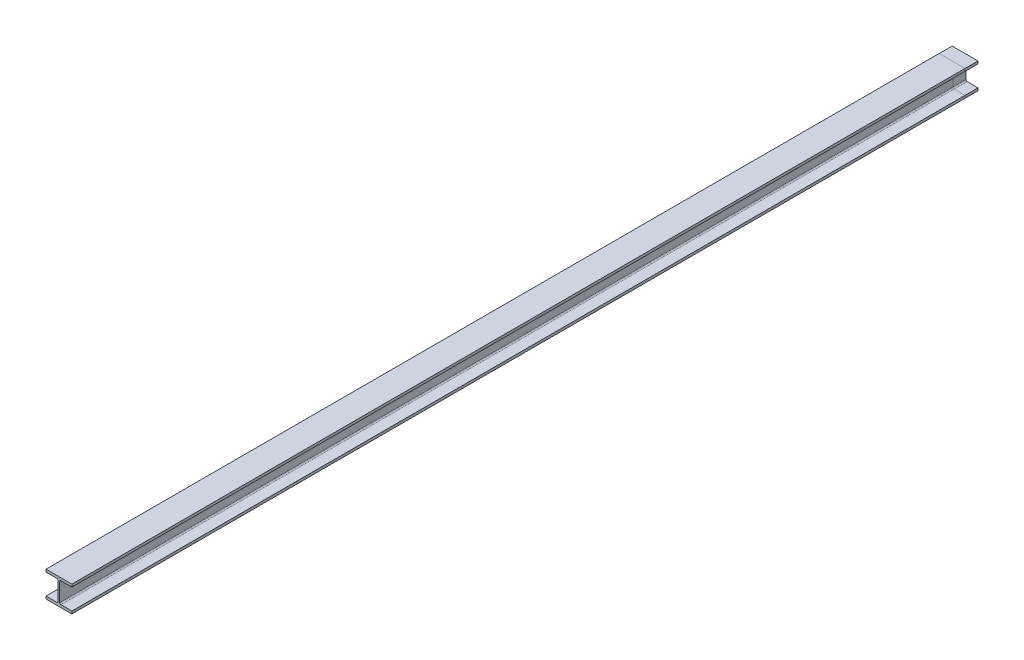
ISO-10303-21;
HEADER;
FILE_DESCRIPTION(('STEP AP214'),'2;1');
FILE_NAME('part.step','',(''),(''),'','','');
FILE_SCHEMA(('AUTOMOTIVE_DESIGN { 1 0 10303 214 1 1 1 1 }'));
ENDSEC;
DATA;
#1=APPLICATION_CONTEXT('core data for automotive mechanical design processes');
#2=APPLICATION_PROTOCOL_DEFINITION('international standard','automotive_design',2000,#1);
#3=PRODUCT_CONTEXT('',#1,'mechanical');
#4=PRODUCT('Part','Part','',(#3));
#5=PRODUCT_RELATED_PRODUCT_CATEGORY('part','',(#4));
#6=PRODUCT_DEFINITION_FORMATION('','',#4);
#7=PRODUCT_DEFINITION_CONTEXT('part definition',#1,'design');
#8=PRODUCT_DEFINITION('design','',#6,#7);
#9=PRODUCT_DEFINITION_SHAPE('','',#8);
#10=(LENGTH_UNIT() NAMED_UNIT(*) SI_UNIT(.MILLI.,.METRE.));
#11=(NAMED_UNIT(*) PLANE_ANGLE_UNIT() SI_UNIT($,.RADIAN.));
#12=(NAMED_UNIT(*) SI_UNIT($,.STERADIAN.) SOLID_ANGLE_UNIT());
#13=UNCERTAINTY_MEASURE_WITH_UNIT(LENGTH_MEASURE(1.E-05),#10,'distance_accuracy_value','');
#14=(GEOMETRIC_REPRESENTATION_CONTEXT(3) GLOBAL_UNCERTAINTY_ASSIGNED_CONTEXT((#13)) GLOBAL_UNIT_ASSIGNED_CONTEXT((#10,
#11,#12)) REPRESENTATION_CONTEXT('',''));
#15=CARTESIAN_POINT('',(0.,0.,0.));
#16=DIRECTION('',(0.,0.,1.));
#17=DIRECTION('',(1.,0.,0.));
#18=AXIS2_PLACEMENT_3D('',#15,#16,#17);
#19=CARTESIAN_POINT('',(50.,50.,1750.));
#20=DIRECTION('',(-1.,0.,0.));
#21=DIRECTION('',(0.,0.,1.));
#22=AXIS2_PLACEMENT_3D('',#19,#20,#21);
#23=PLANE('',#22);
#24=DIRECTION('',(0.,0.,-1.));
#25=VECTOR('',#24,1.);
#26=CARTESIAN_POINT('',(50.,50.,1750.));
#27=LINE('',#26,#25);
#28=CARTESIAN_POINT('',(50.,50.,-1700.));
#29=VERTEX_POINT('',#28);
#30=CARTESIAN_POINT('',(50.,50.,-1750.));
#31=VERTEX_POINT('',#30);
#32=EDGE_CURVE('E402',#29,#31,#27,.T.);
#33=ORIENTED_EDGE('',*,*,#32,.F.);
#34=DIRECTION('',(0.,-1.,0.));
#35=VECTOR('',#34,1.);
#36=CARTESIAN_POINT('',(50.,50.,-1700.));
#37=LINE('',#36,#35);
#38=CARTESIAN_POINT('',(50.,40.,-1700.));
#39=VERTEX_POINT('',#38);
#40=EDGE_CURVE('E13',#29,#39,#37,.T.);
#41=ORIENTED_EDGE('',*,*,#40,.T.);
#42=DIRECTION('',(0.,0.,-1.));
#43=VECTOR('',#42,1.);
#44=CARTESIAN_POINT('',(50.,40.,1750.));
#45=LINE('',#44,#43);
#46=CARTESIAN_POINT('',(50.,40.,-1750.));
#47=VERTEX_POINT('',#46);
#48=EDGE_CURVE('E406',#39,#47,#45,.T.);
#49=ORIENTED_EDGE('',*,*,#48,.T.);
#50=DIRECTION('',(0.,1.,0.));
#51=VECTOR('',#50,1.);
#52=CARTESIAN_POINT('',(50.,50.,-1750.));
#53=LINE('',#52,#51);
#54=EDGE_CURVE('E327',#47,#31,#53,.T.);
#55=ORIENTED_EDGE('',*,*,#54,.T.);
#56=EDGE_LOOP('',(#33,#41,#49,#55));
#57=FACE_BOUND('',#56,.T.);
#58=ADVANCED_FACE('F44',(#57),#23,.F.);
#59=CARTESIAN_POINT('',(50.,40.,1750.));
#60=DIRECTION('',(0.,1.,0.));
#61=DIRECTION('',(-1.,0.,0.));
#62=AXIS2_PLACEMENT_3D('',#59,#60,#61);
#63=PLANE('',#62);
#64=ORIENTED_EDGE('',*,*,#48,.F.);
#65=DIRECTION('',(-1.,0.,0.));
#66=VECTOR('',#65,1.);
#67=CARTESIAN_POINT('',(50.,40.,-1700.));
#68=LINE('',#67,#66);
#69=CARTESIAN_POINT('',(8.00000000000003,40.,-1700.));
#70=VERTEX_POINT('',#69);
#71=EDGE_CURVE('E52',#39,#70,#68,.T.);
#72=ORIENTED_EDGE('',*,*,#71,.T.);
#73=DIRECTION('',(0.,0.,-1.));
#74=VECTOR('',#73,1.);
#75=CARTESIAN_POINT('',(8.00000000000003,40.,1750.));
#76=LINE('',#75,#74);
#77=CARTESIAN_POINT('',(8.00000000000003,40.,-1750.));
#78=VERTEX_POINT('',#77);
#79=EDGE_CURVE('E266',#70,#78,#76,.T.);
#80=ORIENTED_EDGE('',*,*,#79,.T.);
#81=DIRECTION('',(1.,0.,0.));
#82=VECTOR('',#81,1.);
#83=CARTESIAN_POINT('',(50.,40.,-1750.));
#84=LINE('',#83,#82);
#85=EDGE_CURVE('E413',#78,#47,#84,.T.);
#86=ORIENTED_EDGE('',*,*,#85,.T.);
#87=EDGE_LOOP('',(#64,#72,#80,#86));
#88=FACE_BOUND('',#87,.T.);
#89=ADVANCED_FACE('F411',(#88),#63,.F.);
#90=CARTESIAN_POINT('',(7.99999999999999,35.,1750.));
#91=DIRECTION('',(0.,0.,-1.));
#92=DIRECTION('',(-1.,0.,0.));
#93=AXIS2_PLACEMENT_3D('',#90,#91,#92);
#94=CYLINDRICAL_SURFACE('',#93,5.);
#95=ORIENTED_EDGE('',*,*,#79,.F.);
#96=CARTESIAN_POINT('',(7.99999999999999,35.,-1700.));
#97=DIRECTION('',(0.,0.,1.));
#98=DIRECTION('',(-1.,0.,0.));
#99=AXIS2_PLACEMENT_3D('',#96,#97,#98);
#100=CIRCLE('',#99,5.);
#101=CARTESIAN_POINT('',(2.99999999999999,35.,-1700.));
#102=VERTEX_POINT('',#101);
#103=EDGE_CURVE('E258',#70,#102,#100,.T.);
#104=ORIENTED_EDGE('',*,*,#103,.T.);
#105=DIRECTION('',(0.,0.,-1.));
#106=VECTOR('',#105,1.);
#107=CARTESIAN_POINT('',(2.99999999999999,35.,1750.));
#108=LINE('',#107,#106);
#109=CARTESIAN_POINT('',(2.99999999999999,35.,-1750.));
#110=VERTEX_POINT('',#109);
#111=EDGE_CURVE('E264',#102,#110,#108,.T.);
#112=ORIENTED_EDGE('',*,*,#111,.T.);
#113=CARTESIAN_POINT('',(7.99999999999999,35.,-1750.));
#114=DIRECTION('',(0.,0.,-1.));
#115=DIRECTION('',(1.,0.,0.));
#116=AXIS2_PLACEMENT_3D('',#113,#114,#115);
#117=CIRCLE('',#116,5.);
#118=EDGE_CURVE('E311',#110,#78,#117,.T.);
#119=ORIENTED_EDGE('',*,*,#118,.T.);
#120=EDGE_LOOP('',(#95,#104,#112,#119));
#121=FACE_BOUND('',#120,.T.);
#122=ADVANCED_FACE('F261',(#121),#94,.F.);
#123=CARTESIAN_POINT('',(3.,35.,1750.));
#124=DIRECTION('',(-1.,0.,0.));
#125=DIRECTION('',(0.,0.,1.));
#126=AXIS2_PLACEMENT_3D('',#123,#124,#125);
#127=PLANE('',#126);
#128=ORIENTED_EDGE('',*,*,#111,.F.);
#129=DIRECTION('',(0.,-1.,0.));
#130=VECTOR('',#129,1.);
#131=CARTESIAN_POINT('',(3.,35.,-1700.));
#132=LINE('',#131,#130);
#133=CARTESIAN_POINT('',(3.,-35.,-1700.));
#134=VERTEX_POINT('',#133);
#135=EDGE_CURVE('E256',#102,#134,#132,.T.);
#136=ORIENTED_EDGE('',*,*,#135,.T.);
#137=DIRECTION('',(0.,0.,-1.));
#138=VECTOR('',#137,1.);
#139=CARTESIAN_POINT('',(3.,-35.,1750.));
#140=LINE('',#139,#138);
#141=CARTESIAN_POINT('',(3.,-35.,-1750.));
#142=VERTEX_POINT('',#141);
#143=EDGE_CURVE('E228',#134,#142,#140,.T.);
#144=ORIENTED_EDGE('',*,*,#143,.T.);
#145=DIRECTION('',(0.,1.,0.));
#146=VECTOR('',#145,1.);
#147=CARTESIAN_POINT('',(3.,35.,-1750.));
#148=LINE('',#147,#146);
#149=EDGE_CURVE('E273',#142,#110,#148,.T.);
#150=ORIENTED_EDGE('',*,*,#149,.T.);
#151=EDGE_LOOP('',(#128,#136,#144,#150));
#152=FACE_BOUND('',#151,.T.);
#153=ADVANCED_FACE('F271',(#152),#127,.F.);
#154=CARTESIAN_POINT('',(8.,-35.,1750.));
#155=DIRECTION('',(0.,0.,-1.));
#156=DIRECTION('',(-1.,0.,0.));
#157=AXIS2_PLACEMENT_3D('',#154,#155,#156);
#158=CYLINDRICAL_SURFACE('',#157,5.);
#159=ORIENTED_EDGE('',*,*,#143,.F.);
#160=CARTESIAN_POINT('',(8.,-35.,-1700.));
#161=DIRECTION('',(0.,0.,1.));
#162=DIRECTION('',(-1.,0.,0.));
#163=AXIS2_PLACEMENT_3D('',#160,#161,#162);
#164=CIRCLE('',#163,5.);
#165=CARTESIAN_POINT('',(8.00000000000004,-40.,-1700.));
#166=VERTEX_POINT('',#165);
#167=EDGE_CURVE('E225',#134,#166,#164,.T.);
#168=ORIENTED_EDGE('',*,*,#167,.T.);
#169=DIRECTION('',(0.,0.,-1.));
#170=VECTOR('',#169,1.);
#171=CARTESIAN_POINT('',(8.00000000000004,-40.,1750.));
#172=LINE('',#171,#170);
#173=CARTESIAN_POINT('',(8.00000000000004,-40.,-1750.));
#174=VERTEX_POINT('',#173);
#175=EDGE_CURVE('E305',#166,#174,#172,.T.);
#176=ORIENTED_EDGE('',*,*,#175,.T.);
#177=CARTESIAN_POINT('',(8.,-35.,-1750.));
#178=DIRECTION('',(0.,0.,-1.));
#179=DIRECTION('',(-1.,0.,0.));
#180=AXIS2_PLACEMENT_3D('',#177,#178,#179);
#181=CIRCLE('',#180,5.);
#182=EDGE_CURVE('E306',#174,#142,#181,.T.);
#183=ORIENTED_EDGE('',*,*,#182,.T.);
#184=EDGE_LOOP('',(#159,#168,#176,#183));
#185=FACE_BOUND('',#184,.T.);
#186=ADVANCED_FACE('F496',(#185),#158,.F.);
#187=CARTESIAN_POINT('',(50.,-40.,1750.));
#188=DIRECTION('',(0.,-1.,0.));
#189=DIRECTION('',(1.,0.,0.));
#190=AXIS2_PLACEMENT_3D('',#187,#188,#189);
#191=PLANE('',#190);
#192=ORIENTED_EDGE('',*,*,#175,.F.);
#193=DIRECTION('',(1.,0.,0.));
#194=VECTOR('',#193,1.);
#195=CARTESIAN_POINT('',(50.,-40.,-1700.));
#196=LINE('',#195,#194);
#197=CARTESIAN_POINT('',(50.,-40.,-1700.));
#198=VERTEX_POINT('',#197);
#199=EDGE_CURVE('E253',#166,#198,#196,.T.);
#200=ORIENTED_EDGE('',*,*,#199,.T.);
#201=DIRECTION('',(0.,0.,-1.));
#202=VECTOR('',#201,1.);
#203=CARTESIAN_POINT('',(50.,-40.,1750.));
#204=LINE('',#203,#202);
#205=CARTESIAN_POINT('',(50.,-40.,-1750.));
#206=VERTEX_POINT('',#205);
#207=EDGE_CURVE('E362',#198,#206,#204,.T.);
#208=ORIENTED_EDGE('',*,*,#207,.T.);
#209=DIRECTION('',(-1.,0.,0.));
#210=VECTOR('',#209,1.);
#211=CARTESIAN_POINT('',(50.,-40.,-1750.));
#212=LINE('',#211,#210);
#213=EDGE_CURVE('E222',#206,#174,#212,.T.);
#214=ORIENTED_EDGE('',*,*,#213,.T.);
#215=EDGE_LOOP('',(#192,#200,#208,#214));
#216=FACE_BOUND('',#215,.T.);
#217=ADVANCED_FACE('F493',(#216),#191,.F.);
#218=CARTESIAN_POINT('',(50.,-50.,1750.));
#219=DIRECTION('',(-1.,0.,0.));
#220=DIRECTION('',(0.,0.,1.));
#221=AXIS2_PLACEMENT_3D('',#218,#219,#220);
#222=PLANE('',#221);
#223=ORIENTED_EDGE('',*,*,#207,.F.);
#224=DIRECTION('',(0.,-1.,0.));
#225=VECTOR('',#224,1.);
#226=CARTESIAN_POINT('',(50.,-50.,-1700.));
#227=LINE('',#226,#225);
#228=CARTESIAN_POINT('',(50.,-50.,-1700.));
#229=VERTEX_POINT('',#228);
#230=EDGE_CURVE('E251',#198,#229,#227,.T.);
#231=ORIENTED_EDGE('',*,*,#230,.T.);
#232=DIRECTION('',(0.,0.,-1.));
#233=VECTOR('',#232,1.);
#234=CARTESIAN_POINT('',(50.,-50.,1750.));
#235=LINE('',#234,#233);
#236=CARTESIAN_POINT('',(50.,-50.,-1750.));
#237=VERTEX_POINT('',#236);
#238=EDGE_CURVE('E366',#229,#237,#235,.T.);
#239=ORIENTED_EDGE('',*,*,#238,.T.);
#240=DIRECTION('',(0.,1.,0.));
#241=VECTOR('',#240,1.);
#242=CARTESIAN_POINT('',(50.,-50.,-1750.));
#243=LINE('',#242,#241);
#244=EDGE_CURVE('E354',#237,#206,#243,.T.);
#245=ORIENTED_EDGE('',*,*,#244,.T.);
#246=EDGE_LOOP('',(#223,#231,#239,#245));
#247=FACE_BOUND('',#246,.T.);
#248=ADVANCED_FACE('F501',(#247),#222,.F.);
#249=CARTESIAN_POINT('',(-50.,-50.,1750.));
#250=DIRECTION('',(0.,1.,0.));
#251=DIRECTION('',(0.,0.,1.));
#252=AXIS2_PLACEMENT_3D('',#249,#250,#251);
#253=PLANE('',#252);
#254=ORIENTED_EDGE('',*,*,#238,.F.);
#255=DIRECTION('',(-1.,0.,0.));
#256=VECTOR('',#255,1.);
#257=CARTESIAN_POINT('',(-50.,-50.,-1700.));
#258=LINE('',#257,#256);
#259=CARTESIAN_POINT('',(-50.,-50.,-1700.));
#260=VERTEX_POINT('',#259);
#261=EDGE_CURVE('E249',#229,#260,#258,.T.);
#262=ORIENTED_EDGE('',*,*,#261,.T.);
#263=DIRECTION('',(0.,0.,-1.));
#264=VECTOR('',#263,1.);
#265=CARTESIAN_POINT('',(-50.,-50.,1750.));
#266=LINE('',#265,#264);
#267=CARTESIAN_POINT('',(-50.,-50.,-1750.));
#268=VERTEX_POINT('',#267);
#269=EDGE_CURVE('E370',#260,#268,#266,.T.);
#270=ORIENTED_EDGE('',*,*,#269,.T.);
#271=DIRECTION('',(1.,0.,0.));
#272=VECTOR('',#271,1.);
#273=CARTESIAN_POINT('',(-50.,-50.,-1750.));
#274=LINE('',#273,#272);
#275=EDGE_CURVE('E350',#268,#237,#274,.T.);
#276=ORIENTED_EDGE('',*,*,#275,.T.);
#277=EDGE_LOOP('',(#254,#262,#270,#276));
#278=FACE_BOUND('',#277,.T.);
#279=ADVANCED_FACE('F503',(#278),#253,.F.);
#280=CARTESIAN_POINT('',(-50.,-50.,1750.));
#281=DIRECTION('',(1.,0.,0.));
#282=DIRECTION('',(0.,0.,-1.));
#283=AXIS2_PLACEMENT_3D('',#280,#281,#282);
#284=PLANE('',#283);
#285=ORIENTED_EDGE('',*,*,#269,.F.);
#286=DIRECTION('',(0.,1.,0.));
#287=VECTOR('',#286,1.);
#288=CARTESIAN_POINT('',(-50.,-50.,-1700.));
#289=LINE('',#288,#287);
#290=CARTESIAN_POINT('',(-50.,-40.,-1700.));
#291=VERTEX_POINT('',#290);
#292=EDGE_CURVE('E247',#260,#291,#289,.T.);
#293=ORIENTED_EDGE('',*,*,#292,.T.);
#294=DIRECTION('',(0.,0.,-1.));
#295=VECTOR('',#294,1.);
#296=CARTESIAN_POINT('',(-50.,-40.,1750.));
#297=LINE('',#296,#295);
#298=CARTESIAN_POINT('',(-50.,-40.,-1750.));
#299=VERTEX_POINT('',#298);
#300=EDGE_CURVE('E374',#291,#299,#297,.T.);
#301=ORIENTED_EDGE('',*,*,#300,.T.);
#302=DIRECTION('',(0.,-1.,0.));
#303=VECTOR('',#302,1.);
#304=CARTESIAN_POINT('',(-50.,-50.,-1750.));
#305=LINE('',#304,#303);
#306=EDGE_CURVE('E348',#299,#268,#305,.T.);
#307=ORIENTED_EDGE('',*,*,#306,.T.);
#308=EDGE_LOOP('',(#285,#293,#301,#307));
#309=FACE_BOUND('',#308,.T.);
#310=ADVANCED_FACE('F505',(#309),#284,.F.);
#311=CARTESIAN_POINT('',(-50.,-40.,1750.));
#312=DIRECTION('',(0.,-1.,0.));
#313=DIRECTION('',(1.,0.,0.));
#314=AXIS2_PLACEMENT_3D('',#311,#312,#313);
#315=PLANE('',#314);
#316=ORIENTED_EDGE('',*,*,#300,.F.);
#317=DIRECTION('',(1.,0.,0.));
#318=VECTOR('',#317,1.);
#319=CARTESIAN_POINT('',(-50.,-40.,-1700.));
#320=LINE('',#319,#318);
#321=CARTESIAN_POINT('',(-8.00000000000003,-40.,-1700.));
#322=VERTEX_POINT('',#321);
#323=EDGE_CURVE('E245',#291,#322,#320,.T.);
#324=ORIENTED_EDGE('',*,*,#323,.T.);
#325=DIRECTION('',(0.,0.,-1.));
#326=VECTOR('',#325,1.);
#327=CARTESIAN_POINT('',(-8.00000000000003,-40.,1750.));
#328=LINE('',#327,#326);
#329=CARTESIAN_POINT('',(-8.00000000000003,-40.,-1750.));
#330=VERTEX_POINT('',#329);
#331=EDGE_CURVE('E378',#322,#330,#328,.T.);
#332=ORIENTED_EDGE('',*,*,#331,.T.);
#333=DIRECTION('',(-1.,0.,0.));
#334=VECTOR('',#333,1.);
#335=CARTESIAN_POINT('',(-50.,-40.,-1750.));
#336=LINE('',#335,#334);
#337=EDGE_CURVE('E345',#330,#299,#336,.T.);
#338=ORIENTED_EDGE('',*,*,#337,.T.);
#339=EDGE_LOOP('',(#316,#324,#332,#338));
#340=FACE_BOUND('',#339,.T.);
#341=ADVANCED_FACE('F511',(#340),#315,.F.);
#342=CARTESIAN_POINT('',(-7.99999999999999,-35.,1750.));
#343=DIRECTION('',(0.,0.,-1.));
#344=DIRECTION('',(-1.,0.,0.));
#345=AXIS2_PLACEMENT_3D('',#342,#343,#344);
#346=CYLINDRICAL_SURFACE('',#345,5.);
#347=ORIENTED_EDGE('',*,*,#331,.F.);
#348=CARTESIAN_POINT('',(-7.99999999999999,-35.,-1700.));
#349=DIRECTION('',(0.,0.,1.));
#350=DIRECTION('',(-1.,0.,0.));
#351=AXIS2_PLACEMENT_3D('',#348,#349,#350);
#352=CIRCLE('',#351,5.);
#353=CARTESIAN_POINT('',(-2.99999999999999,-35.,-1700.));
#354=VERTEX_POINT('',#353);
#355=EDGE_CURVE('E243',#322,#354,#352,.T.);
#356=ORIENTED_EDGE('',*,*,#355,.T.);
#357=DIRECTION('',(0.,0.,-1.));
#358=VECTOR('',#357,1.);
#359=CARTESIAN_POINT('',(-2.99999999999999,-35.,1750.));
#360=LINE('',#359,#358);
#361=CARTESIAN_POINT('',(-2.99999999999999,-35.,-1750.));
#362=VERTEX_POINT('',#361);
#363=EDGE_CURVE('E382',#354,#362,#360,.T.);
#364=ORIENTED_EDGE('',*,*,#363,.T.);
#365=CARTESIAN_POINT('',(-7.99999999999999,-35.,-1750.));
#366=DIRECTION('',(0.,0.,-1.));
#367=DIRECTION('',(-1.,0.,0.));
#368=AXIS2_PLACEMENT_3D('',#365,#366,#367);
#369=CIRCLE('',#368,5.);
#370=EDGE_CURVE('E342',#362,#330,#369,.T.);
#371=ORIENTED_EDGE('',*,*,#370,.T.);
#372=EDGE_LOOP('',(#347,#356,#364,#371));
#373=FACE_BOUND('',#372,.T.);
#374=ADVANCED_FACE('F513',(#373),#346,.F.);
#375=CARTESIAN_POINT('',(-2.99999999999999,35.,1750.));
#376=DIRECTION('',(1.,0.,0.));
#377=DIRECTION('',(0.,0.,-1.));
#378=AXIS2_PLACEMENT_3D('',#375,#376,#377);
#379=PLANE('',#378);
#380=ORIENTED_EDGE('',*,*,#363,.F.);
#381=DIRECTION('',(0.,1.,0.));
#382=VECTOR('',#381,1.);
#383=CARTESIAN_POINT('',(-2.99999999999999,35.,-1700.));
#384=LINE('',#383,#382);
#385=CARTESIAN_POINT('',(-2.99999999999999,35.,-1700.));
#386=VERTEX_POINT('',#385);
#387=EDGE_CURVE('E241',#354,#386,#384,.T.);
#388=ORIENTED_EDGE('',*,*,#387,.T.);
#389=DIRECTION('',(0.,0.,-1.));
#390=VECTOR('',#389,1.);
#391=CARTESIAN_POINT('',(-2.99999999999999,35.,1750.));
#392=LINE('',#391,#390);
#393=CARTESIAN_POINT('',(-2.99999999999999,35.,-1750.));
#394=VERTEX_POINT('',#393);
#395=EDGE_CURVE('E386',#386,#394,#392,.T.);
#396=ORIENTED_EDGE('',*,*,#395,.T.);
#397=DIRECTION('',(0.,-1.,0.));
#398=VECTOR('',#397,1.);
#399=CARTESIAN_POINT('',(-2.99999999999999,35.,-1750.));
#400=LINE('',#399,#398);
#401=EDGE_CURVE('E337',#394,#362,#400,.T.);
#402=ORIENTED_EDGE('',*,*,#401,.T.);
#403=EDGE_LOOP('',(#380,#388,#396,#402));
#404=FACE_BOUND('',#403,.T.);
#405=ADVANCED_FACE('F515',(#404),#379,.F.);
#406=CARTESIAN_POINT('',(-7.99999999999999,35.,1750.));
#407=DIRECTION('',(0.,0.,-1.));
#408=DIRECTION('',(-1.,0.,0.));
#409=AXIS2_PLACEMENT_3D('',#406,#407,#408);
#410=CYLINDRICAL_SURFACE('',#409,5.);
#411=ORIENTED_EDGE('',*,*,#395,.F.);
#412=CARTESIAN_POINT('',(-7.99999999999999,35.,-1700.));
#413=DIRECTION('',(0.,0.,1.));
#414=DIRECTION('',(-1.,0.,0.));
#415=AXIS2_PLACEMENT_3D('',#412,#413,#414);
#416=CIRCLE('',#415,5.);
#417=CARTESIAN_POINT('',(-8.00000000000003,40.,-1700.));
#418=VERTEX_POINT('',#417);
#419=EDGE_CURVE('E239',#386,#418,#416,.T.);
#420=ORIENTED_EDGE('',*,*,#419,.T.);
#421=DIRECTION('',(0.,0.,-1.));
#422=VECTOR('',#421,1.);
#423=CARTESIAN_POINT('',(-8.00000000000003,40.,1750.));
#424=LINE('',#423,#422);
#425=CARTESIAN_POINT('',(-8.00000000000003,40.,-1750.));
#426=VERTEX_POINT('',#425);
#427=EDGE_CURVE('E390',#418,#426,#424,.T.);
#428=ORIENTED_EDGE('',*,*,#427,.T.);
#429=CARTESIAN_POINT('',(-7.99999999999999,35.,-1750.));
#430=DIRECTION('',(0.,0.,-1.));
#431=DIRECTION('',(1.,0.,0.));
#432=AXIS2_PLACEMENT_3D('',#429,#430,#431);
#433=CIRCLE('',#432,5.);
#434=EDGE_CURVE('E335',#426,#394,#433,.T.);
#435=ORIENTED_EDGE('',*,*,#434,.T.);
#436=EDGE_LOOP('',(#411,#420,#428,#435));
#437=FACE_BOUND('',#436,.T.);
#438=ADVANCED_FACE('F519',(#437),#410,.F.);
#439=CARTESIAN_POINT('',(-50.,40.,1750.));
#440=DIRECTION('',(0.,1.,0.));
#441=DIRECTION('',(-1.,0.,0.));
#442=AXIS2_PLACEMENT_3D('',#439,#440,#441);
#443=PLANE('',#442);
#444=ORIENTED_EDGE('',*,*,#427,.F.);
#445=DIRECTION('',(-1.,0.,0.));
#446=VECTOR('',#445,1.);
#447=CARTESIAN_POINT('',(-50.,40.,-1700.));
#448=LINE('',#447,#446);
#449=CARTESIAN_POINT('',(-50.,40.,-1700.));
#450=VERTEX_POINT('',#449);
#451=EDGE_CURVE('E237',#418,#450,#448,.T.);
#452=ORIENTED_EDGE('',*,*,#451,.T.);
#453=DIRECTION('',(0.,0.,-1.));
#454=VECTOR('',#453,1.);
#455=CARTESIAN_POINT('',(-50.,40.,1750.));
#456=LINE('',#455,#454);
#457=CARTESIAN_POINT('',(-50.,40.,-1750.));
#458=VERTEX_POINT('',#457);
#459=EDGE_CURVE('E394',#450,#458,#456,.T.);
#460=ORIENTED_EDGE('',*,*,#459,.T.);
#461=DIRECTION('',(1.,0.,0.));
#462=VECTOR('',#461,1.);
#463=CARTESIAN_POINT('',(-50.,40.,-1750.));
#464=LINE('',#463,#462);
#465=EDGE_CURVE('E332',#458,#426,#464,.T.);
#466=ORIENTED_EDGE('',*,*,#465,.T.);
#467=EDGE_LOOP('',(#444,#452,#460,#466));
#468=FACE_BOUND('',#467,.T.);
#469=ADVANCED_FACE('F521',(#468),#443,.F.);
#470=CARTESIAN_POINT('',(-50.,50.,1750.));
#471=DIRECTION('',(1.,0.,0.));
#472=DIRECTION('',(0.,0.,-1.));
#473=AXIS2_PLACEMENT_3D('',#470,#471,#472);
#474=PLANE('',#473);
#475=ORIENTED_EDGE('',*,*,#459,.F.);
#476=DIRECTION('',(0.,1.,0.));
#477=VECTOR('',#476,1.);
#478=CARTESIAN_POINT('',(-50.,50.,-1700.));
#479=LINE('',#478,#477);
#480=CARTESIAN_POINT('',(-50.,50.,-1700.));
#481=VERTEX_POINT('',#480);
#482=EDGE_CURVE('E231',#450,#481,#479,.T.);
#483=ORIENTED_EDGE('',*,*,#482,.T.);
#484=DIRECTION('',(0.,0.,-1.));
#485=VECTOR('',#484,1.);
#486=CARTESIAN_POINT('',(-50.,50.,1750.));
#487=LINE('',#486,#485);
#488=CARTESIAN_POINT('',(-50.,50.,-1750.));
#489=VERTEX_POINT('',#488);
#490=EDGE_CURVE('E398',#481,#489,#487,.T.);
#491=ORIENTED_EDGE('',*,*,#490,.T.);
#492=DIRECTION('',(0.,-1.,0.));
#493=VECTOR('',#492,1.);
#494=CARTESIAN_POINT('',(-50.,50.,-1750.));
#495=LINE('',#494,#493);
#496=EDGE_CURVE('E326',#489,#458,#495,.T.);
#497=ORIENTED_EDGE('',*,*,#496,.T.);
#498=EDGE_LOOP('',(#475,#483,#491,#497));
#499=FACE_BOUND('',#498,.T.);
#500=ADVANCED_FACE('F523',(#499),#474,.F.);
#501=CARTESIAN_POINT('',(-50.,50.,1750.));
#502=DIRECTION('',(0.,-1.,0.));
#503=DIRECTION('',(0.,0.,-1.));
#504=AXIS2_PLACEMENT_3D('',#501,#502,#503);
#505=PLANE('',#504);
#506=ORIENTED_EDGE('',*,*,#490,.F.);
#507=DIRECTION('',(1.,0.,0.));
#508=VECTOR('',#507,1.);
#509=CARTESIAN_POINT('',(-50.,50.,-1700.));
#510=LINE('',#509,#508);
#511=EDGE_CURVE('E227',#481,#29,#510,.T.);
#512=ORIENTED_EDGE('',*,*,#511,.T.);
#513=ORIENTED_EDGE('',*,*,#32,.T.);
#514=DIRECTION('',(-1.,0.,0.));
#515=VECTOR('',#514,1.);
#516=CARTESIAN_POINT('',(-50.,50.,-1750.));
#517=LINE('',#516,#515);
#518=EDGE_CURVE('E320',#31,#489,#517,.T.);
#519=ORIENTED_EDGE('',*,*,#518,.T.);
#520=EDGE_LOOP('',(#506,#512,#513,#519));
#521=FACE_BOUND('',#520,.T.);
#522=ADVANCED_FACE('F424',(#521),#505,.F.);
#523=ORIENTED_EDGE('',*,*,#167,.F.);
#524=CARTESIAN_POINT('',(3.,-35.,1750.));
#525=VERTEX_POINT('',#524);
#526=EDGE_CURVE('E207',#525,#134,#140,.T.);
#527=ORIENTED_EDGE('',*,*,#526,.F.);
#528=CARTESIAN_POINT('',(8.,-35.,1750.));
#529=DIRECTION('',(0.,0.,-1.));
#530=DIRECTION('',(-1.,0.,0.));
#531=AXIS2_PLACEMENT_3D('',#528,#529,#530);
#532=CIRCLE('',#531,5.);
#533=CARTESIAN_POINT('',(8.00000000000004,-40.,1750.));
#534=VERTEX_POINT('',#533);
#535=EDGE_CURVE('E213',#534,#525,#532,.T.);
#536=ORIENTED_EDGE('',*,*,#535,.F.);
#537=EDGE_CURVE('E360',#534,#166,#172,.T.);
#538=ORIENTED_EDGE('',*,*,#537,.T.);
#539=EDGE_LOOP('',(#523,#527,#536,#538));
#540=FACE_BOUND('',#539,.T.);
#541=ADVANCED_FACE('F46',(#540),#158,.F.);
#542=ORIENTED_EDGE('',*,*,#135,.F.);
#543=CARTESIAN_POINT('',(2.99999999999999,35.,1750.));
#544=VERTEX_POINT('',#543);
#545=EDGE_CURVE('E209',#544,#102,#108,.T.);
#546=ORIENTED_EDGE('',*,*,#545,.F.);
#547=DIRECTION('',(0.,1.,0.));
#548=VECTOR('',#547,1.);
#549=CARTESIAN_POINT('',(3.,35.,1750.));
#550=LINE('',#549,#548);
#551=EDGE_CURVE('E202',#525,#544,#550,.T.);
#552=ORIENTED_EDGE('',*,*,#551,.F.);
#553=ORIENTED_EDGE('',*,*,#526,.T.);
#554=EDGE_LOOP('',(#542,#546,#552,#553));
#555=FACE_BOUND('',#554,.T.);
#556=ADVANCED_FACE('F205',(#555),#127,.F.);
#557=ORIENTED_EDGE('',*,*,#103,.F.);
#558=CARTESIAN_POINT('',(8.00000000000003,40.,1750.));
#559=VERTEX_POINT('',#558);
#560=EDGE_CURVE('E275',#559,#70,#76,.T.);
#561=ORIENTED_EDGE('',*,*,#560,.F.);
#562=CARTESIAN_POINT('',(7.99999999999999,35.,1750.));
#563=DIRECTION('',(0.,0.,-1.));
#564=DIRECTION('',(1.,0.,0.));
#565=AXIS2_PLACEMENT_3D('',#562,#563,#564);
#566=CIRCLE('',#565,5.);
#567=EDGE_CURVE('E212',#544,#559,#566,.T.);
#568=ORIENTED_EDGE('',*,*,#567,.F.);
#569=ORIENTED_EDGE('',*,*,#545,.T.);
#570=EDGE_LOOP('',(#557,#561,#568,#569));
#571=FACE_BOUND('',#570,.T.);
#572=ADVANCED_FACE('F276',(#571),#94,.F.);
#573=ORIENTED_EDGE('',*,*,#71,.F.);
#574=CARTESIAN_POINT('',(50.,40.,1750.));
#575=VERTEX_POINT('',#574);
#576=EDGE_CURVE('E407',#575,#39,#45,.T.);
#577=ORIENTED_EDGE('',*,*,#576,.F.);
#578=DIRECTION('',(1.,0.,0.));
#579=VECTOR('',#578,1.);
#580=CARTESIAN_POINT('',(50.,40.,1750.));
#581=LINE('',#580,#579);
#582=EDGE_CURVE('E278',#559,#575,#581,.T.);
#583=ORIENTED_EDGE('',*,*,#582,.F.);
#584=ORIENTED_EDGE('',*,*,#560,.T.);
#585=EDGE_LOOP('',(#573,#577,#583,#584));
#586=FACE_BOUND('',#585,.T.);
#587=ADVANCED_FACE('F436',(#586),#63,.F.);
#588=ORIENTED_EDGE('',*,*,#40,.F.);
#589=CARTESIAN_POINT('',(50.,50.,1750.));
#590=VERTEX_POINT('',#589);
#591=EDGE_CURVE('E403',#590,#29,#27,.T.);
#592=ORIENTED_EDGE('',*,*,#591,.F.);
#593=DIRECTION('',(0.,1.,0.));
#594=VECTOR('',#593,1.);
#595=CARTESIAN_POINT('',(50.,50.,1750.));
#596=LINE('',#595,#594);
#597=EDGE_CURVE('E280',#575,#590,#596,.T.);
#598=ORIENTED_EDGE('',*,*,#597,.F.);
#599=ORIENTED_EDGE('',*,*,#576,.T.);
#600=EDGE_LOOP('',(#588,#592,#598,#599));
#601=FACE_BOUND('',#600,.T.);
#602=ADVANCED_FACE('F434',(#601),#23,.F.);
#603=ORIENTED_EDGE('',*,*,#511,.F.);
#604=CARTESIAN_POINT('',(-50.,50.,1750.));
#605=VERTEX_POINT('',#604);
#606=EDGE_CURVE('E399',#605,#481,#487,.T.);
#607=ORIENTED_EDGE('',*,*,#606,.F.);
#608=DIRECTION('',(-1.,0.,0.));
#609=VECTOR('',#608,1.);
#610=CARTESIAN_POINT('',(-50.,50.,1750.));
#611=LINE('',#610,#609);
#612=EDGE_CURVE('E284',#590,#605,#611,.T.);
#613=ORIENTED_EDGE('',*,*,#612,.F.);
#614=ORIENTED_EDGE('',*,*,#591,.T.);
#615=EDGE_LOOP('',(#603,#607,#613,#614));
#616=FACE_BOUND('',#615,.T.);
#617=ADVANCED_FACE('F428',(#616),#505,.F.);
#618=ORIENTED_EDGE('',*,*,#482,.F.);
#619=CARTESIAN_POINT('',(-50.,40.,1750.));
#620=VERTEX_POINT('',#619);
#621=EDGE_CURVE('E395',#620,#450,#456,.T.);
#622=ORIENTED_EDGE('',*,*,#621,.F.);
#623=DIRECTION('',(0.,-1.,0.));
#624=VECTOR('',#623,1.);
#625=CARTESIAN_POINT('',(-50.,50.,1750.));
#626=LINE('',#625,#624);
#627=EDGE_CURVE('E286',#605,#620,#626,.T.);
#628=ORIENTED_EDGE('',*,*,#627,.F.);
#629=ORIENTED_EDGE('',*,*,#606,.T.);
#630=EDGE_LOOP('',(#618,#622,#628,#629));
#631=FACE_BOUND('',#630,.T.);
#632=ADVANCED_FACE('F442',(#631),#474,.F.);
#633=ORIENTED_EDGE('',*,*,#451,.F.);
#634=CARTESIAN_POINT('',(-8.00000000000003,40.,1750.));
#635=VERTEX_POINT('',#634);
#636=EDGE_CURVE('E391',#635,#418,#424,.T.);
#637=ORIENTED_EDGE('',*,*,#636,.F.);
#638=DIRECTION('',(1.,0.,0.));
#639=VECTOR('',#638,1.);
#640=CARTESIAN_POINT('',(-50.,40.,1750.));
#641=LINE('',#640,#639);
#642=EDGE_CURVE('E288',#620,#635,#641,.T.);
#643=ORIENTED_EDGE('',*,*,#642,.F.);
#644=ORIENTED_EDGE('',*,*,#621,.T.);
#645=EDGE_LOOP('',(#633,#637,#643,#644));
#646=FACE_BOUND('',#645,.T.);
#647=ADVANCED_FACE('F446',(#646),#443,.F.);
#648=ORIENTED_EDGE('',*,*,#419,.F.);
#649=CARTESIAN_POINT('',(-2.99999999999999,35.,1750.));
#650=VERTEX_POINT('',#649);
#651=EDGE_CURVE('E387',#650,#386,#392,.T.);
#652=ORIENTED_EDGE('',*,*,#651,.F.);
#653=CARTESIAN_POINT('',(-7.99999999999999,35.,1750.));
#654=DIRECTION('',(0.,0.,-1.));
#655=DIRECTION('',(1.,0.,0.));
#656=AXIS2_PLACEMENT_3D('',#653,#654,#655);
#657=CIRCLE('',#656,5.);
#658=EDGE_CURVE('E290',#635,#650,#657,.T.);
#659=ORIENTED_EDGE('',*,*,#658,.F.);
#660=ORIENTED_EDGE('',*,*,#636,.T.);
#661=EDGE_LOOP('',(#648,#652,#659,#660));
#662=FACE_BOUND('',#661,.T.);
#663=ADVANCED_FACE('F452',(#662),#410,.F.);
#664=ORIENTED_EDGE('',*,*,#387,.F.);
#665=CARTESIAN_POINT('',(-2.99999999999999,-35.,1750.));
#666=VERTEX_POINT('',#665);
#667=EDGE_CURVE('E383',#666,#354,#360,.T.);
#668=ORIENTED_EDGE('',*,*,#667,.F.);
#669=DIRECTION('',(0.,-1.,0.));
#670=VECTOR('',#669,1.);
#671=CARTESIAN_POINT('',(-2.99999999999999,35.,1750.));
#672=LINE('',#671,#670);
#673=EDGE_CURVE('E292',#650,#666,#672,.T.);
#674=ORIENTED_EDGE('',*,*,#673,.F.);
#675=ORIENTED_EDGE('',*,*,#651,.T.);
#676=EDGE_LOOP('',(#664,#668,#674,#675));
#677=FACE_BOUND('',#676,.T.);
#678=ADVANCED_FACE('F459',(#677),#379,.F.);
#679=ORIENTED_EDGE('',*,*,#355,.F.);
#680=CARTESIAN_POINT('',(-8.00000000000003,-40.,1750.));
#681=VERTEX_POINT('',#680);
#682=EDGE_CURVE('E379',#681,#322,#328,.T.);
#683=ORIENTED_EDGE('',*,*,#682,.F.);
#684=CARTESIAN_POINT('',(-7.99999999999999,-35.,1750.));
#685=DIRECTION('',(0.,0.,-1.));
#686=DIRECTION('',(-1.,0.,0.));
#687=AXIS2_PLACEMENT_3D('',#684,#685,#686);
#688=CIRCLE('',#687,5.);
#689=EDGE_CURVE('E294',#666,#681,#688,.T.);
#690=ORIENTED_EDGE('',*,*,#689,.F.);
#691=ORIENTED_EDGE('',*,*,#667,.T.);
#692=EDGE_LOOP('',(#679,#683,#690,#691));
#693=FACE_BOUND('',#692,.T.);
#694=ADVANCED_FACE('F463',(#693),#346,.F.);
#695=ORIENTED_EDGE('',*,*,#323,.F.);
#696=CARTESIAN_POINT('',(-50.,-40.,1750.));
#697=VERTEX_POINT('',#696);
#698=EDGE_CURVE('E375',#697,#291,#297,.T.);
#699=ORIENTED_EDGE('',*,*,#698,.F.);
#700=DIRECTION('',(-1.,0.,0.));
#701=VECTOR('',#700,1.);
#702=CARTESIAN_POINT('',(-50.,-40.,1750.));
#703=LINE('',#702,#701);
#704=EDGE_CURVE('E296',#681,#697,#703,.T.);
#705=ORIENTED_EDGE('',*,*,#704,.F.);
#706=ORIENTED_EDGE('',*,*,#682,.T.);
#707=EDGE_LOOP('',(#695,#699,#705,#706));
#708=FACE_BOUND('',#707,.T.);
#709=ADVANCED_FACE('F469',(#708),#315,.F.);
#710=ORIENTED_EDGE('',*,*,#292,.F.);
#711=CARTESIAN_POINT('',(-50.,-50.,1750.));
#712=VERTEX_POINT('',#711);
#713=EDGE_CURVE('E371',#712,#260,#266,.T.);
#714=ORIENTED_EDGE('',*,*,#713,.F.);
#715=DIRECTION('',(0.,-1.,0.));
#716=VECTOR('',#715,1.);
#717=CARTESIAN_POINT('',(-50.,-50.,1750.));
#718=LINE('',#717,#716);
#719=EDGE_CURVE('E298',#697,#712,#718,.T.);
#720=ORIENTED_EDGE('',*,*,#719,.F.);
#721=ORIENTED_EDGE('',*,*,#698,.T.);
#722=EDGE_LOOP('',(#710,#714,#720,#721));
#723=FACE_BOUND('',#722,.T.);
#724=ADVANCED_FACE('F476',(#723),#284,.F.);
#725=ORIENTED_EDGE('',*,*,#261,.F.);
#726=CARTESIAN_POINT('',(50.,-50.,1750.));
#727=VERTEX_POINT('',#726);
#728=EDGE_CURVE('E367',#727,#229,#235,.T.);
#729=ORIENTED_EDGE('',*,*,#728,.F.);
#730=DIRECTION('',(1.,0.,0.));
#731=VECTOR('',#730,1.);
#732=CARTESIAN_POINT('',(-50.,-50.,1750.));
#733=LINE('',#732,#731);
#734=EDGE_CURVE('E300',#712,#727,#733,.T.);
#735=ORIENTED_EDGE('',*,*,#734,.F.);
#736=ORIENTED_EDGE('',*,*,#713,.T.);
#737=EDGE_LOOP('',(#725,#729,#735,#736));
#738=FACE_BOUND('',#737,.T.);
#739=ADVANCED_FACE('F480',(#738),#253,.F.);
#740=ORIENTED_EDGE('',*,*,#230,.F.);
#741=CARTESIAN_POINT('',(50.,-40.,1750.));
#742=VERTEX_POINT('',#741);
#743=EDGE_CURVE('E363',#742,#198,#204,.T.);
#744=ORIENTED_EDGE('',*,*,#743,.F.);
#745=DIRECTION('',(0.,1.,0.));
#746=VECTOR('',#745,1.);
#747=CARTESIAN_POINT('',(50.,-50.,1750.));
#748=LINE('',#747,#746);
#749=EDGE_CURVE('E302',#727,#742,#748,.T.);
#750=ORIENTED_EDGE('',*,*,#749,.F.);
#751=ORIENTED_EDGE('',*,*,#728,.T.);
#752=EDGE_LOOP('',(#740,#744,#750,#751));
#753=FACE_BOUND('',#752,.T.);
#754=ADVANCED_FACE('F486',(#753),#222,.F.);
#755=ORIENTED_EDGE('',*,*,#199,.F.);
#756=ORIENTED_EDGE('',*,*,#537,.F.);
#757=DIRECTION('',(-1.,0.,0.));
#758=VECTOR('',#757,1.);
#759=CARTESIAN_POINT('',(50.,-40.,1750.));
#760=LINE('',#759,#758);
#761=EDGE_CURVE('E218',#742,#534,#760,.T.);
#762=ORIENTED_EDGE('',*,*,#761,.F.);
#763=ORIENTED_EDGE('',*,*,#743,.T.);
#764=EDGE_LOOP('',(#755,#756,#762,#763));
#765=FACE_BOUND('',#764,.T.);
#766=ADVANCED_FACE('F490',(#765),#191,.F.);
#767=CARTESIAN_POINT('',(8.,-35.,1750.));
#768=DIRECTION('',(0.,0.,-1.));
#769=DIRECTION('',(-1.,0.,0.));
#770=AXIS2_PLACEMENT_3D('',#767,#768,#769);
#771=PLANE('',#770);
#772=ORIENTED_EDGE('',*,*,#535,.T.);
#773=ORIENTED_EDGE('',*,*,#551,.T.);
#774=ORIENTED_EDGE('',*,*,#567,.T.);
#775=ORIENTED_EDGE('',*,*,#582,.T.);
#776=ORIENTED_EDGE('',*,*,#597,.T.);
#777=ORIENTED_EDGE('',*,*,#612,.T.);
#778=ORIENTED_EDGE('',*,*,#627,.T.);
#779=ORIENTED_EDGE('',*,*,#642,.T.);
#780=ORIENTED_EDGE('',*,*,#658,.T.);
#781=ORIENTED_EDGE('',*,*,#673,.T.);
#782=ORIENTED_EDGE('',*,*,#689,.T.);
#783=ORIENTED_EDGE('',*,*,#704,.T.);
#784=ORIENTED_EDGE('',*,*,#719,.T.);
#785=ORIENTED_EDGE('',*,*,#734,.T.);
#786=ORIENTED_EDGE('',*,*,#749,.T.);
#787=ORIENTED_EDGE('',*,*,#761,.T.);
#788=EDGE_LOOP('',(#772,#773,#774,#775,#776,#777,#778,#779,#780,#781,#782,#783,#784,#785,#786,#787));
#789=FACE_BOUND('',#788,.T.);
#790=ADVANCED_FACE('F216',(#789),#771,.F.);
#791=CARTESIAN_POINT('',(8.,-35.,-1750.));
#792=DIRECTION('',(0.,0.,-1.));
#793=DIRECTION('',(-1.,0.,0.));
#794=AXIS2_PLACEMENT_3D('',#791,#792,#793);
#795=PLANE('',#794);
#796=ORIENTED_EDGE('',*,*,#182,.F.);
#797=ORIENTED_EDGE('',*,*,#213,.F.);
#798=ORIENTED_EDGE('',*,*,#244,.F.);
#799=ORIENTED_EDGE('',*,*,#275,.F.);
#800=ORIENTED_EDGE('',*,*,#306,.F.);
#801=ORIENTED_EDGE('',*,*,#337,.F.);
#802=ORIENTED_EDGE('',*,*,#370,.F.);
#803=ORIENTED_EDGE('',*,*,#401,.F.);
#804=ORIENTED_EDGE('',*,*,#434,.F.);
#805=ORIENTED_EDGE('',*,*,#465,.F.);
#806=ORIENTED_EDGE('',*,*,#496,.F.);
#807=ORIENTED_EDGE('',*,*,#518,.F.);
#808=ORIENTED_EDGE('',*,*,#54,.F.);
#809=ORIENTED_EDGE('',*,*,#85,.F.);
#810=ORIENTED_EDGE('',*,*,#118,.F.);
#811=ORIENTED_EDGE('',*,*,#149,.F.);
#812=EDGE_LOOP('',(#796,#797,#798,#799,#800,#801,#802,#803,#804,#805,#806,#807,#808,#809,#810,#811));
#813=FACE_BOUND('',#812,.T.);
#814=ADVANCED_FACE('F417',(#813),#795,.T.);
#815=CLOSED_SHELL('',(#58,#89,#122,#153,#186,#217,#248,#279,#310,#341,#374,#405,#438,#469,#500,
#522,#541,#556,#572,#587,#602,#617,#632,#647,#663,#678,#694,#709,#724,#739,#754,#766,#790,#814));
#816=MANIFOLD_SOLID_BREP('B2',#815);
#817=ADVANCED_BREP_SHAPE_REPRESENTATION('',(#18,#816),#14);
#818=SHAPE_DEFINITION_REPRESENTATION(#9,#817);
ENDSEC;
END-ISO-10303-21;
